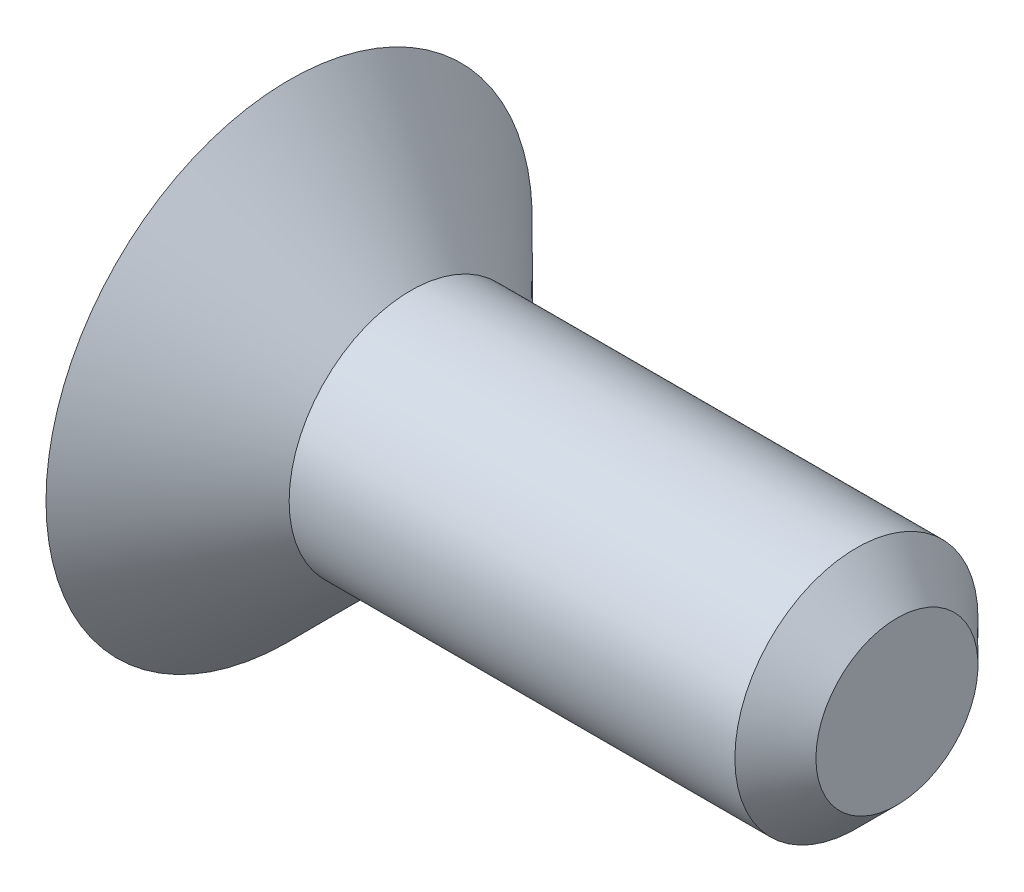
ISO-10303-21;
HEADER;
FILE_DESCRIPTION(('STEP AP214'),'2;1');
FILE_NAME('part.step','',(''),(''),'','','');
FILE_SCHEMA(('AUTOMOTIVE_DESIGN { 1 0 10303 214 1 1 1 1 }'));
ENDSEC;
DATA;
#1=APPLICATION_CONTEXT('core data for automotive mechanical design processes');
#2=APPLICATION_PROTOCOL_DEFINITION('international standard','automotive_design',2000,#1);
#3=PRODUCT_CONTEXT('',#1,'mechanical');
#4=PRODUCT('Part','Part','',(#3));
#5=PRODUCT_RELATED_PRODUCT_CATEGORY('part','',(#4));
#6=PRODUCT_DEFINITION_FORMATION('','',#4);
#7=PRODUCT_DEFINITION_CONTEXT('part definition',#1,'design');
#8=PRODUCT_DEFINITION('design','',#6,#7);
#9=PRODUCT_DEFINITION_SHAPE('','',#8);
#10=(LENGTH_UNIT() NAMED_UNIT(*) SI_UNIT(.MILLI.,.METRE.));
#11=(NAMED_UNIT(*) PLANE_ANGLE_UNIT() SI_UNIT($,.RADIAN.));
#12=(NAMED_UNIT(*) SI_UNIT($,.STERADIAN.) SOLID_ANGLE_UNIT());
#13=UNCERTAINTY_MEASURE_WITH_UNIT(LENGTH_MEASURE(1.E-05),#10,'distance_accuracy_value','');
#14=(GEOMETRIC_REPRESENTATION_CONTEXT(3) GLOBAL_UNCERTAINTY_ASSIGNED_CONTEXT((#13)) GLOBAL_UNIT_ASSIGNED_CONTEXT((#10,
#11,#12)) REPRESENTATION_CONTEXT('',''));
#15=CARTESIAN_POINT('',(0.,0.,0.));
#16=DIRECTION('',(0.,0.,1.));
#17=DIRECTION('',(1.,0.,0.));
#18=AXIS2_PLACEMENT_3D('',#15,#16,#17);
#19=CARTESIAN_POINT('',(1.5,1.56125112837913E-13,0.));
#20=DIRECTION('',(-1.00000000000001,0.,0.));
#21=DIRECTION('',(0.,0.,1.00000000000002));
#22=AXIS2_PLACEMENT_3D('',#19,#20,#21);
#23=CONICAL_SURFACE('',#22,1.5,0.785398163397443);
#24=CARTESIAN_POINT('',(0.,0.,0.));
#25=DIRECTION('',(-1.00000000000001,0.,0.));
#26=DIRECTION('',(0.,0.,1.00000000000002));
#27=AXIS2_PLACEMENT_3D('',#24,#25,#26);
#28=CIRCLE('',#27,3.);
#29=CARTESIAN_POINT('',(0.,0.,3.00000000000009));
#30=VERTEX_POINT('',#29);
#31=EDGE_CURVE('E11',#30,#30,#28,.T.);
#32=ORIENTED_EDGE('',*,*,#31,.F.);
#33=EDGE_LOOP('',(#32));
#34=FACE_BOUND('',#33,.T.);
#35=CARTESIAN_POINT('',(1.5,1.56125112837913E-13,0.));
#36=DIRECTION('',(-1.00000000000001,0.,0.));
#37=DIRECTION('',(0.,0.,1.00000000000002));
#38=AXIS2_PLACEMENT_3D('',#35,#36,#37);
#39=CIRCLE('',#38,1.5);
#40=CARTESIAN_POINT('',(1.5,1.60850499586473E-13,1.49999999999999));
#41=VERTEX_POINT('',#40);
#42=EDGE_CURVE('E133',#41,#41,#39,.T.);
#43=ORIENTED_EDGE('',*,*,#42,.T.);
#44=EDGE_LOOP('',(#43));
#45=FACE_BOUND('',#44,.T.);
#46=ADVANCED_FACE('F31',(#34,#45),#23,.T.);
#47=CARTESIAN_POINT('',(1.52655665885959E-13,3.00000000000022,0.));
#48=DIRECTION('',(1.00000000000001,0.,0.));
#49=DIRECTION('',(0.,0.,-1.00000000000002));
#50=AXIS2_PLACEMENT_3D('',#47,#48,#49);
#51=PLANE('',#50);
#52=DIRECTION('',(0.,0.500000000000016,0.866025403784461));
#53=VECTOR('',#52,1.);
#54=CARTESIAN_POINT('',(0.,-1.44337567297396,0.));
#55=LINE('',#54,#53);
#56=CARTESIAN_POINT('',(0.,-1.44337567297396,0.));
#57=VERTEX_POINT('',#56);
#58=CARTESIAN_POINT('',(0.,-0.721687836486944,1.25000000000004));
#59=VERTEX_POINT('',#58);
#60=EDGE_CURVE('E99',#57,#59,#55,.T.);
#61=ORIENTED_EDGE('',*,*,#60,.F.);
#62=DIRECTION('',(0.,-0.50000000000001,0.866025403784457));
#63=VECTOR('',#62,1.);
#64=CARTESIAN_POINT('',(0.,-0.721687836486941,-1.25000000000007));
#65=LINE('',#64,#63);
#66=CARTESIAN_POINT('',(0.,-0.721687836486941,-1.25000000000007));
#67=VERTEX_POINT('',#66);
#68=EDGE_CURVE('E45',#67,#57,#65,.T.);
#69=ORIENTED_EDGE('',*,*,#68,.F.);
#70=DIRECTION('',(0.,-1.00000000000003,0.));
#71=VECTOR('',#70,1.);
#72=CARTESIAN_POINT('',(0.,0.721687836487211,-1.25000000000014));
#73=LINE('',#72,#71);
#74=CARTESIAN_POINT('',(0.,0.721687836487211,-1.25000000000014));
#75=VERTEX_POINT('',#74);
#76=EDGE_CURVE('E115',#75,#67,#73,.T.);
#77=ORIENTED_EDGE('',*,*,#76,.F.);
#78=DIRECTION('',(0.,-0.500000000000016,-0.866025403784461));
#79=VECTOR('',#78,1.);
#80=CARTESIAN_POINT('',(0.,1.44337567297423,0.));
#81=LINE('',#80,#79);
#82=CARTESIAN_POINT('',(0.,1.44337567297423,0.));
#83=VERTEX_POINT('',#82);
#84=EDGE_CURVE('E109',#83,#75,#81,.T.);
#85=ORIENTED_EDGE('',*,*,#84,.F.);
#86=DIRECTION('',(0.,0.500000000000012,-0.866025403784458));
#87=VECTOR('',#86,1.);
#88=CARTESIAN_POINT('',(0.,0.721687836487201,1.2499999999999));
#89=LINE('',#88,#87);
#90=CARTESIAN_POINT('',(0.,0.721687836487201,1.2499999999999));
#91=VERTEX_POINT('',#90);
#92=EDGE_CURVE('E107',#91,#83,#89,.T.);
#93=ORIENTED_EDGE('',*,*,#92,.F.);
#94=DIRECTION('',(0.,1.00000000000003,0.));
#95=VECTOR('',#94,1.);
#96=CARTESIAN_POINT('',(0.,-0.721687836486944,1.25000000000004));
#97=LINE('',#96,#95);
#98=EDGE_CURVE('E88',#59,#91,#97,.T.);
#99=ORIENTED_EDGE('',*,*,#98,.F.);
#100=EDGE_LOOP('',(#61,#69,#77,#85,#93,#99));
#101=FACE_BOUND('',#100,.T.);
#102=ORIENTED_EDGE('',*,*,#31,.T.);
#103=EDGE_LOOP('',(#102));
#104=FACE_BOUND('',#103,.T.);
#105=ADVANCED_FACE('F103',(#101,#104),#51,.F.);
#106=CARTESIAN_POINT('',(7.50000000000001,1.00000000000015,0.));
#107=DIRECTION('',(-1.00000000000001,0.,0.));
#108=DIRECTION('',(0.,0.,1.00000000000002));
#109=AXIS2_PLACEMENT_3D('',#106,#107,#108);
#110=PLANE('',#109);
#111=CARTESIAN_POINT('',(7.50000000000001,1.2490009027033E-13,0.));
#112=DIRECTION('',(-1.00000000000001,0.,0.));
#113=DIRECTION('',(0.,0.,1.00000000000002));
#114=AXIS2_PLACEMENT_3D('',#111,#112,#113);
#115=CIRCLE('',#114,1.);
#116=CARTESIAN_POINT('',(7.50000000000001,1.28050348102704E-13,0.999999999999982));
#117=VERTEX_POINT('',#116);
#118=EDGE_CURVE('E38',#117,#117,#115,.T.);
#119=ORIENTED_EDGE('',*,*,#118,.F.);
#120=EDGE_LOOP('',(#119));
#121=FACE_BOUND('',#120,.T.);
#122=ADVANCED_FACE('F149',(#121),#110,.F.);
#123=CARTESIAN_POINT('',(7.50000000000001,1.2490009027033E-13,0.));
#124=DIRECTION('',(-1.00000000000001,0.,0.));
#125=DIRECTION('',(0.,0.,1.00000000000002));
#126=AXIS2_PLACEMENT_3D('',#123,#124,#125);
#127=CONICAL_SURFACE('',#126,1.,0.785398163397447);
#128=CARTESIAN_POINT('',(7.00000000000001,1.2490009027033E-13,0.));
#129=DIRECTION('',(-1.00000000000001,0.,0.));
#130=DIRECTION('',(0.,0.,1.00000000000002));
#131=AXIS2_PLACEMENT_3D('',#128,#129,#130);
#132=CIRCLE('',#131,1.5);
#133=CARTESIAN_POINT('',(7.00000000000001,1.29625477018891E-13,1.49999999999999));
#134=VERTEX_POINT('',#133);
#135=EDGE_CURVE('E142',#134,#134,#132,.T.);
#136=ORIENTED_EDGE('',*,*,#135,.F.);
#137=EDGE_LOOP('',(#136));
#138=FACE_BOUND('',#137,.T.);
#139=ORIENTED_EDGE('',*,*,#118,.T.);
#140=EDGE_LOOP('',(#139));
#141=FACE_BOUND('',#140,.T.);
#142=ADVANCED_FACE('F147',(#138,#141),#127,.T.);
#143=CARTESIAN_POINT('',(-5.06820973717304,0.,0.));
#144=DIRECTION('',(-1.00000000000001,0.,0.));
#145=DIRECTION('',(0.,0.,1.00000000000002));
#146=AXIS2_PLACEMENT_3D('',#143,#144,#145);
#147=CYLINDRICAL_SURFACE('',#146,1.5);
#148=ORIENTED_EDGE('',*,*,#42,.F.);
#149=EDGE_LOOP('',(#148));
#150=FACE_BOUND('',#149,.T.);
#151=ORIENTED_EDGE('',*,*,#135,.T.);
#152=EDGE_LOOP('',(#151));
#153=FACE_BOUND('',#152,.T.);
#154=ADVANCED_FACE('F156',(#150,#153),#147,.T.);
#155=CARTESIAN_POINT('',(2.,-0.721687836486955,-1.25000000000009));
#156=DIRECTION('',(0.,-0.866025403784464,-0.500000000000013));
#157=DIRECTION('',(0.,0.500000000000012,-0.866025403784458));
#158=AXIS2_PLACEMENT_3D('',#155,#156,#157);
#159=PLANE('',#158);
#160=ORIENTED_EDGE('',*,*,#68,.T.);
#161=DIRECTION('',(-1.00000000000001,0.,0.));
#162=VECTOR('',#161,1.);
#163=CARTESIAN_POINT('',(2.,-1.44337567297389,0.));
#164=LINE('',#163,#162);
#165=CARTESIAN_POINT('',(2.,-1.44337567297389,0.));
#166=VERTEX_POINT('',#165);
#167=EDGE_CURVE('E96',#166,#57,#164,.T.);
#168=ORIENTED_EDGE('',*,*,#167,.F.);
#169=DIRECTION('',(0.,-0.50000000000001,0.866025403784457));
#170=VECTOR('',#169,1.);
#171=CARTESIAN_POINT('',(2.,-0.721687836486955,-1.25000000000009));
#172=LINE('',#171,#170);
#173=CARTESIAN_POINT('',(2.,-0.721687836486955,-1.25000000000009));
#174=VERTEX_POINT('',#173);
#175=EDGE_CURVE('E117',#174,#166,#172,.T.);
#176=ORIENTED_EDGE('',*,*,#175,.F.);
#177=DIRECTION('',(-1.00000000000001,0.,0.));
#178=VECTOR('',#177,1.);
#179=CARTESIAN_POINT('',(2.,-0.721687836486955,-1.25000000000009));
#180=LINE('',#179,#178);
#181=EDGE_CURVE('E52',#174,#67,#180,.T.);
#182=ORIENTED_EDGE('',*,*,#181,.T.);
#183=EDGE_LOOP('',(#160,#168,#176,#182));
#184=FACE_BOUND('',#183,.T.);
#185=ADVANCED_FACE('F169',(#184),#159,.F.);
#186=CARTESIAN_POINT('',(2.,0.721687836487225,-1.25000000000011));
#187=DIRECTION('',(0.,0.,-1.00000000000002));
#188=DIRECTION('',(-1.00000000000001,0.,0.));
#189=AXIS2_PLACEMENT_3D('',#186,#187,#188);
#190=PLANE('',#189);
#191=ORIENTED_EDGE('',*,*,#76,.T.);
#192=ORIENTED_EDGE('',*,*,#181,.F.);
#193=DIRECTION('',(0.,-1.00000000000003,0.));
#194=VECTOR('',#193,1.);
#195=CARTESIAN_POINT('',(2.,0.721687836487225,-1.25000000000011));
#196=LINE('',#195,#194);
#197=CARTESIAN_POINT('',(2.,0.721687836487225,-1.25000000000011));
#198=VERTEX_POINT('',#197);
#199=EDGE_CURVE('E129',#198,#174,#196,.T.);
#200=ORIENTED_EDGE('',*,*,#199,.F.);
#201=DIRECTION('',(-1.00000000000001,0.,0.));
#202=VECTOR('',#201,1.);
#203=CARTESIAN_POINT('',(2.,0.721687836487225,-1.25000000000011));
#204=LINE('',#203,#202);
#205=EDGE_CURVE('E134',#198,#75,#204,.T.);
#206=ORIENTED_EDGE('',*,*,#205,.T.);
#207=EDGE_LOOP('',(#191,#192,#200,#206));
#208=FACE_BOUND('',#207,.T.);
#209=ADVANCED_FACE('F175',(#208),#190,.F.);
#210=CARTESIAN_POINT('',(2.,1.44337567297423,0.));
#211=DIRECTION('',(0.,0.866025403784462,-0.50000000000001));
#212=DIRECTION('',(0.,0.500000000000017,0.86602540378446));
#213=AXIS2_PLACEMENT_3D('',#210,#211,#212);
#214=PLANE('',#213);
#215=ORIENTED_EDGE('',*,*,#84,.T.);
#216=ORIENTED_EDGE('',*,*,#205,.F.);
#217=DIRECTION('',(0.,-0.500000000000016,-0.866025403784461));
#218=VECTOR('',#217,1.);
#219=CARTESIAN_POINT('',(2.,1.44337567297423,0.));
#220=LINE('',#219,#218);
#221=CARTESIAN_POINT('',(2.,1.44337567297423,0.));
#222=VERTEX_POINT('',#221);
#223=EDGE_CURVE('E126',#222,#198,#220,.T.);
#224=ORIENTED_EDGE('',*,*,#223,.F.);
#225=DIRECTION('',(-1.00000000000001,0.,0.));
#226=VECTOR('',#225,1.);
#227=CARTESIAN_POINT('',(2.,1.44337567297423,0.));
#228=LINE('',#227,#226);
#229=EDGE_CURVE('E136',#222,#83,#228,.T.);
#230=ORIENTED_EDGE('',*,*,#229,.T.);
#231=EDGE_LOOP('',(#215,#216,#224,#230));
#232=FACE_BOUND('',#231,.T.);
#233=ADVANCED_FACE('F186',(#232),#214,.F.);
#234=CARTESIAN_POINT('',(2.,0.721687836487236,1.24999999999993));
#235=DIRECTION('',(0.,0.866025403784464,0.500000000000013));
#236=DIRECTION('',(0.,-0.500000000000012,0.866025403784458));
#237=AXIS2_PLACEMENT_3D('',#234,#235,#236);
#238=PLANE('',#237);
#239=ORIENTED_EDGE('',*,*,#92,.T.);
#240=ORIENTED_EDGE('',*,*,#229,.F.);
#241=DIRECTION('',(0.,0.500000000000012,-0.866025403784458));
#242=VECTOR('',#241,1.);
#243=CARTESIAN_POINT('',(2.,0.721687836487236,1.24999999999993));
#244=LINE('',#243,#242);
#245=CARTESIAN_POINT('',(2.,0.721687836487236,1.24999999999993));
#246=VERTEX_POINT('',#245);
#247=EDGE_CURVE('E123',#246,#222,#244,.T.);
#248=ORIENTED_EDGE('',*,*,#247,.F.);
#249=DIRECTION('',(-1.00000000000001,0.,0.));
#250=VECTOR('',#249,1.);
#251=CARTESIAN_POINT('',(2.,0.721687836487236,1.24999999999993));
#252=LINE('',#251,#250);
#253=EDGE_CURVE('E95',#246,#91,#252,.T.);
#254=ORIENTED_EDGE('',*,*,#253,.T.);
#255=EDGE_LOOP('',(#239,#240,#248,#254));
#256=FACE_BOUND('',#255,.T.);
#257=ADVANCED_FACE('F183',(#256),#238,.F.);
#258=CARTESIAN_POINT('',(2.,-0.721687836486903,1.25000000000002));
#259=DIRECTION('',(0.,0.,1.00000000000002));
#260=DIRECTION('',(0.,-1.00000000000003,0.));
#261=AXIS2_PLACEMENT_3D('',#258,#259,#260);
#262=PLANE('',#261);
#263=ORIENTED_EDGE('',*,*,#98,.T.);
#264=ORIENTED_EDGE('',*,*,#253,.F.);
#265=DIRECTION('',(0.,1.00000000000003,0.));
#266=VECTOR('',#265,1.);
#267=CARTESIAN_POINT('',(2.,-0.721687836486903,1.25000000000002));
#268=LINE('',#267,#266);
#269=CARTESIAN_POINT('',(2.,-0.721687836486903,1.25000000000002));
#270=VERTEX_POINT('',#269);
#271=EDGE_CURVE('E91',#270,#246,#268,.T.);
#272=ORIENTED_EDGE('',*,*,#271,.F.);
#273=DIRECTION('',(-1.00000000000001,0.,0.));
#274=VECTOR('',#273,1.);
#275=CARTESIAN_POINT('',(2.,-0.721687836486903,1.25000000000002));
#276=LINE('',#275,#274);
#277=EDGE_CURVE('E84',#270,#59,#276,.T.);
#278=ORIENTED_EDGE('',*,*,#277,.T.);
#279=EDGE_LOOP('',(#263,#264,#272,#278));
#280=FACE_BOUND('',#279,.T.);
#281=ADVANCED_FACE('F86',(#280),#262,.F.);
#282=CARTESIAN_POINT('',(2.,-1.44337567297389,0.));
#283=DIRECTION('',(0.,-0.866025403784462,0.50000000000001));
#284=DIRECTION('',(0.,-0.500000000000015,-0.86602540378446));
#285=AXIS2_PLACEMENT_3D('',#282,#283,#284);
#286=PLANE('',#285);
#287=ORIENTED_EDGE('',*,*,#60,.T.);
#288=ORIENTED_EDGE('',*,*,#277,.F.);
#289=DIRECTION('',(0.,0.500000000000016,0.866025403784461));
#290=VECTOR('',#289,1.);
#291=CARTESIAN_POINT('',(2.,-1.44337567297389,0.));
#292=LINE('',#291,#290);
#293=EDGE_CURVE('E120',#166,#270,#292,.T.);
#294=ORIENTED_EDGE('',*,*,#293,.F.);
#295=ORIENTED_EDGE('',*,*,#167,.T.);
#296=EDGE_LOOP('',(#287,#288,#294,#295));
#297=FACE_BOUND('',#296,.T.);
#298=ADVANCED_FACE('F100',(#297),#286,.F.);
#299=CARTESIAN_POINT('',(2.,-0.721687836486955,-1.25000000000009));
#300=DIRECTION('',(1.00000000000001,0.,0.));
#301=DIRECTION('',(0.,0.,-1.00000000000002));
#302=AXIS2_PLACEMENT_3D('',#299,#300,#301);
#303=PLANE('',#302);
#304=ORIENTED_EDGE('',*,*,#175,.T.);
#305=ORIENTED_EDGE('',*,*,#293,.T.);
#306=ORIENTED_EDGE('',*,*,#271,.T.);
#307=ORIENTED_EDGE('',*,*,#247,.T.);
#308=ORIENTED_EDGE('',*,*,#223,.T.);
#309=ORIENTED_EDGE('',*,*,#199,.T.);
#310=EDGE_LOOP('',(#304,#305,#306,#307,#308,#309));
#311=FACE_BOUND('',#310,.T.);
#312=ADVANCED_FACE('F180',(#311),#303,.F.);
#313=CLOSED_SHELL('',(#46,#105,#122,#142,#154,#185,#209,#233,#257,#281,#298,#312));
#314=MANIFOLD_SOLID_BREP('B2',#313);
#315=ADVANCED_BREP_SHAPE_REPRESENTATION('',(#18,#314),#14);
#316=SHAPE_DEFINITION_REPRESENTATION(#9,#315);
ENDSEC;
END-ISO-10303-21;
